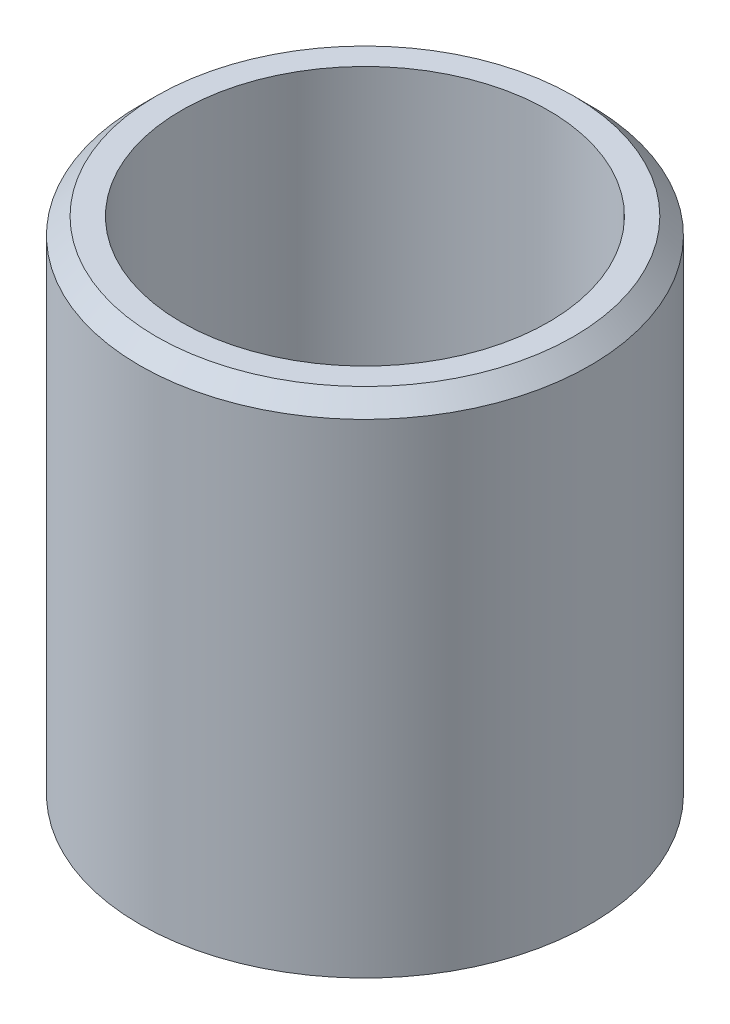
from build123d import *

# Parameters (mm, degrees)
ESQUISSE1_R      = 13.5
ESQUISSE1_R_2    = 11
EXTRUSION1_DEPTH = 30
CHANFREIN1_SIZE  = 1


with BuildPart() as part:
    # Esquisse1 → Extrusion1 (new body)
    with BuildSketch(Plane(origin=(0, 0, 0), x_dir=(1, 0, 0), z_dir=(0, 1, 0))):
        with Locations(Location((0, 0, 0), (0, 0, 270))):
            Circle(ESQUISSE1_R)
        with Locations(Location((0, 0, 0), (0, 0, 270))):
            Circle(ESQUISSE1_R_2, mode=Mode.SUBTRACT)
    extrude(amount=EXTRUSION1_DEPTH)

    # Chanfrein1
    chanfrein1_edges = [part.edges().sort_by_distance(p)[0] for p in [
        (0, 30, -13.5),
    ]]
    chamfer(chanfrein1_edges, length=CHANFREIN1_SIZE)


solid = part.part
